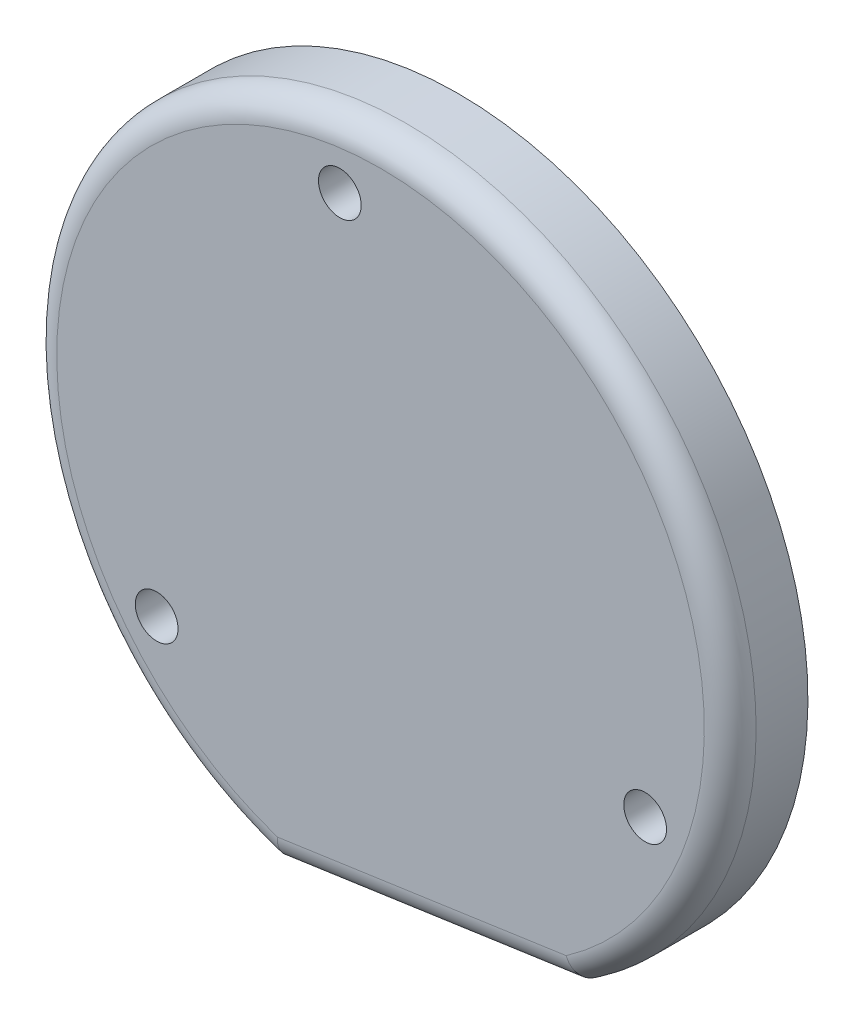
from build123d import *

# Parameters (mm, degrees)
SKETCH_1_R         = 17.5
SKETCH_1_R_2       = 13.204
EXTRUDE_1_DEPTH    = 4.75
EXTRUDE_2_DEPTH    = 6
HOLE_WIZARD_M4_1_D = 3.3
FILLET_1_R         = 2


with BuildPart() as part:
    # Sketch 1 → Extrude 1 (new body)
    with BuildSketch(Plane.XY):
        with Locations(Location((0, 0, 0), (0, 0, 270))):
            Circle(SKETCH_1_R)
        with Locations(Location((0, 0, 0), (0, 0, 270))):
            Circle(SKETCH_1_R_2, mode=Mode.SUBTRACT)
    extrude(amount=EXTRUDE_1_DEPTH)

    # Sketch 2 → Extrude 2 (add)
    with BuildSketch(Plane.XY.offset(4.75)):
        with BuildLine():
            Line((15.083643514, -22.393831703), (-8.135310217, -25.745227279))
            ThreePointArc((-8.135310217, -25.745227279), (-3.85717474, 26.723065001), (15.083643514, -22.393831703))
        make_face()
    extrude(amount=EXTRUDE_2_DEPTH)

    # Hole Wizard M4 _1 (through all)
    with Locations(Plane.XY.offset(10.75)):
        with Locations((-3.142883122, 21.77434926), (20.428581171, -8.165358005), (-17.285698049, -13.608991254)):
            Hole(HOLE_WIZARD_M4_1_D / 2)

    # Fillet 1
    fillet_1_edges = [part.edges().sort_by_distance(p)[0] for p in [
        (-3.85717474, 26.723065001, 10.75),
        (3.474166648, -24.069529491, 10.75),
    ]]
    fillet(fillet_1_edges, radius=FILLET_1_R)


solid = part.part
